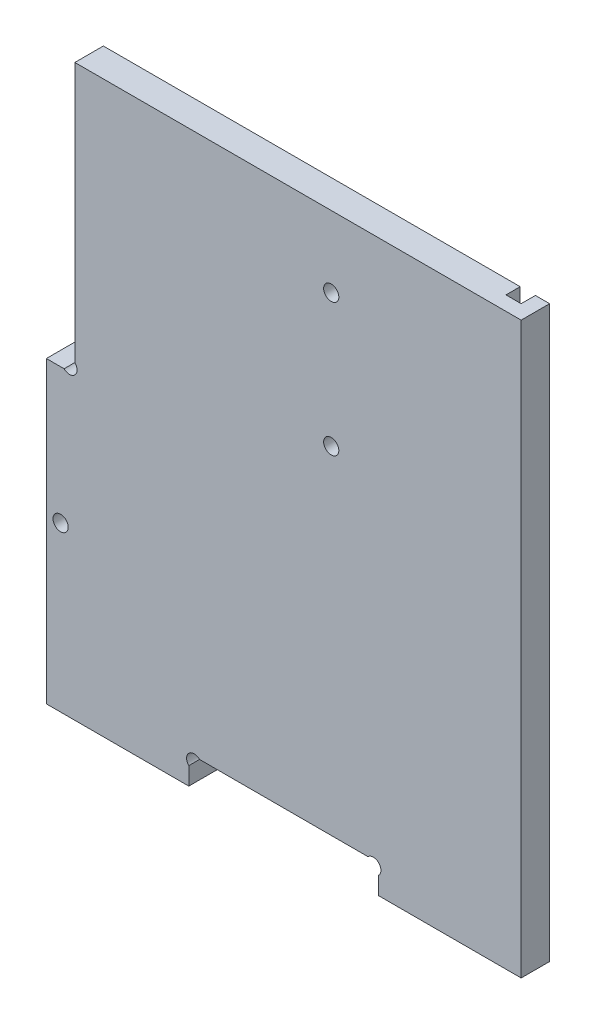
ISO-10303-21;
HEADER;
FILE_DESCRIPTION(('STEP AP214'),'2;1');
FILE_NAME('part.step','',(''),(''),'','','');
FILE_SCHEMA(('AUTOMOTIVE_DESIGN { 1 0 10303 214 1 1 1 1 }'));
ENDSEC;
DATA;
#1=APPLICATION_CONTEXT('core data for automotive mechanical design processes');
#2=APPLICATION_PROTOCOL_DEFINITION('international standard','automotive_design',2000,#1);
#3=PRODUCT_CONTEXT('',#1,'mechanical');
#4=PRODUCT('Part','Part','',(#3));
#5=PRODUCT_RELATED_PRODUCT_CATEGORY('part','',(#4));
#6=PRODUCT_DEFINITION_FORMATION('','',#4);
#7=PRODUCT_DEFINITION_CONTEXT('part definition',#1,'design');
#8=PRODUCT_DEFINITION('design','',#6,#7);
#9=PRODUCT_DEFINITION_SHAPE('','',#8);
#10=(LENGTH_UNIT() NAMED_UNIT(*) SI_UNIT(.MILLI.,.METRE.));
#11=(NAMED_UNIT(*) PLANE_ANGLE_UNIT() SI_UNIT($,.RADIAN.));
#12=(NAMED_UNIT(*) SI_UNIT($,.STERADIAN.) SOLID_ANGLE_UNIT());
#13=UNCERTAINTY_MEASURE_WITH_UNIT(LENGTH_MEASURE(1.E-05),#10,'distance_accuracy_value','');
#14=(GEOMETRIC_REPRESENTATION_CONTEXT(3) GLOBAL_UNCERTAINTY_ASSIGNED_CONTEXT((#13)) GLOBAL_UNIT_ASSIGNED_CONTEXT((#10,
#11,#12)) REPRESENTATION_CONTEXT('',''));
#15=CARTESIAN_POINT('',(0.,0.,0.));
#16=DIRECTION('',(0.,0.,1.));
#17=DIRECTION('',(1.,0.,0.));
#18=AXIS2_PLACEMENT_3D('',#15,#16,#17);
#19=CARTESIAN_POINT('',(18.8686291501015,-1.13137084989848,0.));
#20=DIRECTION('',(0.,0.,1.));
#21=DIRECTION('',(1.,0.,0.));
#22=AXIS2_PLACEMENT_3D('',#19,#20,#21);
#23=PLANE('',#22);
#24=DIRECTION('',(1.,0.,0.));
#25=VECTOR('',#24,1.);
#26=CARTESIAN_POINT('',(50.,-6.,0.));
#27=LINE('',#26,#25);
#28=CARTESIAN_POINT('',(47.,-5.99999999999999,0.));
#29=VERTEX_POINT('',#28);
#30=CARTESIAN_POINT('',(50.,-6.,0.));
#31=VERTEX_POINT('',#30);
#32=EDGE_CURVE('E108',#29,#31,#27,.T.);
#33=ORIENTED_EDGE('',*,*,#32,.F.);
#34=DIRECTION('',(0.,-1.,0.));
#35=VECTOR('',#34,1.);
#36=CARTESIAN_POINT('',(47.,116.031055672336,0.));
#37=LINE('',#36,#35);
#38=CARTESIAN_POINT('',(47.,114.,0.));
#39=VERTEX_POINT('',#38);
#40=EDGE_CURVE('E264',#39,#29,#37,.T.);
#41=ORIENTED_EDGE('',*,*,#40,.F.);
#42=DIRECTION('',(-1.,0.,0.));
#43=VECTOR('',#42,1.);
#44=CARTESIAN_POINT('',(-44.,114.,0.));
#45=LINE('',#44,#43);
#46=CARTESIAN_POINT('',(50.,114.,0.));
#47=VERTEX_POINT('',#46);
#48=EDGE_CURVE('E182',#47,#39,#45,.T.);
#49=ORIENTED_EDGE('',*,*,#48,.F.);
#50=DIRECTION('',(0.,1.,0.));
#51=VECTOR('',#50,1.);
#52=CARTESIAN_POINT('',(50.,114.,0.));
#53=LINE('',#52,#51);
#54=EDGE_CURVE('E177',#31,#47,#53,.T.);
#55=ORIENTED_EDGE('',*,*,#54,.F.);
#56=EDGE_LOOP('',(#33,#41,#49,#55));
#57=FACE_BOUND('',#56,.T.);
#58=ADVANCED_FACE('F37',(#57),#23,.F.);
#59=CARTESIAN_POINT('',(18.8686291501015,-1.13137084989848,6.));
#60=DIRECTION('',(0.,0.,1.));
#61=DIRECTION('',(1.,0.,0.));
#62=AXIS2_PLACEMENT_3D('',#59,#60,#61);
#63=PLANE('',#62);
#64=CARTESIAN_POINT('',(10.,99.,6.));
#65=DIRECTION('',(0.,0.,1.));
#66=DIRECTION('',(1.,0.,0.));
#67=AXIS2_PLACEMENT_3D('',#64,#65,#66);
#68=CIRCLE('',#67,1.60000000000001);
#69=CARTESIAN_POINT('',(11.6,99.,6.));
#70=VERTEX_POINT('',#69);
#71=EDGE_CURVE('E309',#70,#70,#68,.T.);
#72=ORIENTED_EDGE('',*,*,#71,.F.);
#73=EDGE_LOOP('',(#72));
#74=FACE_BOUND('',#73,.T.);
#75=DIRECTION('',(0.,1.,0.));
#76=VECTOR('',#75,1.);
#77=CARTESIAN_POINT('',(50.,114.,6.));
#78=LINE('',#77,#76);
#79=CARTESIAN_POINT('',(50.,-6.,6.));
#80=VERTEX_POINT('',#79);
#81=CARTESIAN_POINT('',(50.,114.,6.));
#82=VERTEX_POINT('',#81);
#83=EDGE_CURVE('E207',#80,#82,#78,.T.);
#84=ORIENTED_EDGE('',*,*,#83,.T.);
#85=DIRECTION('',(-1.,0.,0.));
#86=VECTOR('',#85,1.);
#87=CARTESIAN_POINT('',(-44.,114.,6.));
#88=LINE('',#87,#86);
#89=CARTESIAN_POINT('',(-44.,114.,6.));
#90=VERTEX_POINT('',#89);
#91=EDGE_CURVE('E117',#82,#90,#88,.T.);
#92=ORIENTED_EDGE('',*,*,#91,.T.);
#93=DIRECTION('',(0.,-1.,0.));
#94=VECTOR('',#93,1.);
#95=CARTESIAN_POINT('',(-44.,59.2627416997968,6.));
#96=LINE('',#95,#94);
#97=CARTESIAN_POINT('',(-44.,59.2627416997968,6.));
#98=VERTEX_POINT('',#97);
#99=EDGE_CURVE('E321',#90,#98,#96,.T.);
#100=ORIENTED_EDGE('',*,*,#99,.T.);
#101=CARTESIAN_POINT('',(-45.1313708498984,58.1313708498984,6.));
#102=DIRECTION('',(0.,0.,-1.));
#103=DIRECTION('',(-1.,0.,0.));
#104=AXIS2_PLACEMENT_3D('',#101,#102,#103);
#105=CIRCLE('',#104,1.59999999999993);
#106=CARTESIAN_POINT('',(-46.2627416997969,57.,6.));
#107=VERTEX_POINT('',#106);
#108=EDGE_CURVE('E323',#98,#107,#105,.T.);
#109=ORIENTED_EDGE('',*,*,#108,.T.);
#110=DIRECTION('',(-1.,0.,0.));
#111=VECTOR('',#110,1.);
#112=CARTESIAN_POINT('',(-46.2627416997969,57.,6.));
#113=LINE('',#112,#111);
#114=CARTESIAN_POINT('',(-50.,57.,6.));
#115=VERTEX_POINT('',#114);
#116=EDGE_CURVE('E325',#107,#115,#113,.T.);
#117=ORIENTED_EDGE('',*,*,#116,.T.);
#118=DIRECTION('',(0.,-1.,0.));
#119=VECTOR('',#118,1.);
#120=CARTESIAN_POINT('',(-50.,57.,6.));
#121=LINE('',#120,#119);
#122=CARTESIAN_POINT('',(-50.,-6.,6.));
#123=VERTEX_POINT('',#122);
#124=EDGE_CURVE('E327',#115,#123,#121,.T.);
#125=ORIENTED_EDGE('',*,*,#124,.T.);
#126=DIRECTION('',(1.,0.,0.));
#127=VECTOR('',#126,1.);
#128=CARTESIAN_POINT('',(-20.,-6.,6.));
#129=LINE('',#128,#127);
#130=CARTESIAN_POINT('',(-20.,-6.,6.));
#131=VERTEX_POINT('',#130);
#132=EDGE_CURVE('E329',#123,#131,#129,.T.);
#133=ORIENTED_EDGE('',*,*,#132,.T.);
#134=DIRECTION('',(0.,1.,0.));
#135=VECTOR('',#134,1.);
#136=CARTESIAN_POINT('',(-20.,-2.26274169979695,6.));
#137=LINE('',#136,#135);
#138=CARTESIAN_POINT('',(-20.,-2.26274169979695,6.));
#139=VERTEX_POINT('',#138);
#140=EDGE_CURVE('E331',#131,#139,#137,.T.);
#141=ORIENTED_EDGE('',*,*,#140,.T.);
#142=CARTESIAN_POINT('',(-18.8686291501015,-1.13137084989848,6.));
#143=DIRECTION('',(0.,0.,-1.));
#144=DIRECTION('',(-1.,0.,0.));
#145=AXIS2_PLACEMENT_3D('',#142,#143,#144);
#146=CIRCLE('',#145,1.6);
#147=CARTESIAN_POINT('',(-17.737258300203,0.,6.));
#148=VERTEX_POINT('',#147);
#149=EDGE_CURVE('E333',#139,#148,#146,.T.);
#150=ORIENTED_EDGE('',*,*,#149,.T.);
#151=DIRECTION('',(1.,0.,0.));
#152=VECTOR('',#151,1.);
#153=CARTESIAN_POINT('',(17.737258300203,0.,6.));
#154=LINE('',#153,#152);
#155=CARTESIAN_POINT('',(17.737258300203,0.,6.));
#156=VERTEX_POINT('',#155);
#157=EDGE_CURVE('E155',#148,#156,#154,.T.);
#158=ORIENTED_EDGE('',*,*,#157,.T.);
#159=CARTESIAN_POINT('',(18.8686291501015,-1.13137084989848,6.));
#160=DIRECTION('',(0.,0.,-1.));
#161=DIRECTION('',(1.,0.,0.));
#162=AXIS2_PLACEMENT_3D('',#159,#160,#161);
#163=CIRCLE('',#162,1.6);
#164=CARTESIAN_POINT('',(20.,-2.26274169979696,6.));
#165=VERTEX_POINT('',#164);
#166=EDGE_CURVE('E147',#156,#165,#163,.T.);
#167=ORIENTED_EDGE('',*,*,#166,.T.);
#168=DIRECTION('',(0.,-1.,0.));
#169=VECTOR('',#168,1.);
#170=CARTESIAN_POINT('',(20.,-6.,6.));
#171=LINE('',#170,#169);
#172=CARTESIAN_POINT('',(20.,-6.,6.));
#173=VERTEX_POINT('',#172);
#174=EDGE_CURVE('E152',#165,#173,#171,.T.);
#175=ORIENTED_EDGE('',*,*,#174,.T.);
#176=DIRECTION('',(1.,0.,0.));
#177=VECTOR('',#176,1.);
#178=CARTESIAN_POINT('',(50.,-6.,6.));
#179=LINE('',#178,#177);
#180=EDGE_CURVE('E61',#173,#80,#179,.T.);
#181=ORIENTED_EDGE('',*,*,#180,.T.);
#182=EDGE_LOOP('',(#84,#92,#100,#109,#117,#125,#133,#141,#150,#158,#167,#175,#181));
#183=FACE_BOUND('',#182,.T.);
#184=CARTESIAN_POINT('',(10.,71.,6.));
#185=DIRECTION('',(0.,0.,1.));
#186=DIRECTION('',(-1.,0.,0.));
#187=AXIS2_PLACEMENT_3D('',#184,#185,#186);
#188=CIRCLE('',#187,1.60000000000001);
#189=CARTESIAN_POINT('',(8.4,71.,6.));
#190=VERTEX_POINT('',#189);
#191=EDGE_CURVE('E181',#190,#190,#188,.T.);
#192=ORIENTED_EDGE('',*,*,#191,.F.);
#193=EDGE_LOOP('',(#192));
#194=FACE_BOUND('',#193,.T.);
#195=CARTESIAN_POINT('',(-47.,28.5,6.));
#196=DIRECTION('',(0.,0.,1.));
#197=DIRECTION('',(-1.,0.,0.));
#198=AXIS2_PLACEMENT_3D('',#195,#196,#197);
#199=CIRCLE('',#198,1.6);
#200=CARTESIAN_POINT('',(-48.6,28.5,6.));
#201=VERTEX_POINT('',#200);
#202=EDGE_CURVE('E303',#201,#201,#199,.T.);
#203=ORIENTED_EDGE('',*,*,#202,.F.);
#204=EDGE_LOOP('',(#203));
#205=FACE_BOUND('',#204,.T.);
#206=ADVANCED_FACE('F149',(#74,#183,#194,#205),#63,.T.);
#207=CARTESIAN_POINT('',(10.0000000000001,63.5000000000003,0.));
#208=DIRECTION('',(0.,0.,-1.));
#209=DIRECTION('',(-1.,0.,0.));
#210=AXIS2_PLACEMENT_3D('',#207,#208,#209);
#211=CIRCLE('',#210,1.09999999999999);
#212=CARTESIAN_POINT('',(8.90000000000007,63.5000000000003,0.));
#213=VERTEX_POINT('',#212);
#214=EDGE_CURVE('E278',#213,#213,#211,.T.);
#215=ORIENTED_EDGE('',*,*,#214,.F.);
#216=EDGE_LOOP('',(#215));
#217=FACE_BOUND('',#216,.T.);
#218=CARTESIAN_POINT('',(10.,78.4999999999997,0.));
#219=DIRECTION('',(0.,0.,-1.));
#220=DIRECTION('',(-1.,0.,0.));
#221=AXIS2_PLACEMENT_3D('',#218,#219,#220);
#222=CIRCLE('',#221,1.09999999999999);
#223=CARTESIAN_POINT('',(8.90000000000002,78.4999999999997,0.));
#224=VERTEX_POINT('',#223);
#225=EDGE_CURVE('E282',#224,#224,#222,.T.);
#226=ORIENTED_EDGE('',*,*,#225,.F.);
#227=EDGE_LOOP('',(#226));
#228=FACE_BOUND('',#227,.T.);
#229=CARTESIAN_POINT('',(2.5,99.,0.));
#230=DIRECTION('',(0.,0.,-1.));
#231=DIRECTION('',(1.,0.,0.));
#232=AXIS2_PLACEMENT_3D('',#229,#230,#231);
#233=CIRCLE('',#232,1.1);
#234=CARTESIAN_POINT('',(3.6,99.,0.));
#235=VERTEX_POINT('',#234);
#236=EDGE_CURVE('E288',#235,#235,#233,.T.);
#237=ORIENTED_EDGE('',*,*,#236,.F.);
#238=EDGE_LOOP('',(#237));
#239=FACE_BOUND('',#238,.T.);
#240=CARTESIAN_POINT('',(17.5,99.,0.));
#241=DIRECTION('',(0.,0.,-1.));
#242=DIRECTION('',(-1.,0.,0.));
#243=AXIS2_PLACEMENT_3D('',#240,#241,#242);
#244=CIRCLE('',#243,1.1);
#245=CARTESIAN_POINT('',(16.4,99.,0.));
#246=VERTEX_POINT('',#245);
#247=EDGE_CURVE('E294',#246,#246,#244,.T.);
#248=ORIENTED_EDGE('',*,*,#247,.F.);
#249=EDGE_LOOP('',(#248));
#250=FACE_BOUND('',#249,.T.);
#251=CARTESIAN_POINT('',(10.,99.,0.));
#252=DIRECTION('',(0.,0.,1.));
#253=DIRECTION('',(1.,0.,0.));
#254=AXIS2_PLACEMENT_3D('',#251,#252,#253);
#255=CIRCLE('',#254,1.60000000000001);
#256=CARTESIAN_POINT('',(11.6,99.,0.));
#257=VERTEX_POINT('',#256);
#258=EDGE_CURVE('E306',#257,#257,#255,.T.);
#259=ORIENTED_EDGE('',*,*,#258,.T.);
#260=EDGE_LOOP('',(#259));
#261=FACE_BOUND('',#260,.T.);
#262=CARTESIAN_POINT('',(43.8,114.,0.));
#263=VERTEX_POINT('',#262);
#264=CARTESIAN_POINT('',(-44.,114.,0.));
#265=VERTEX_POINT('',#264);
#266=EDGE_CURVE('E180',#263,#265,#45,.T.);
#267=ORIENTED_EDGE('',*,*,#266,.F.);
#268=DIRECTION('',(0.,1.,0.));
#269=VECTOR('',#268,1.);
#270=CARTESIAN_POINT('',(43.8,116.031055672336,0.));
#271=LINE('',#270,#269);
#272=CARTESIAN_POINT('',(43.8,-5.99999999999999,0.));
#273=VERTEX_POINT('',#272);
#274=EDGE_CURVE('E253',#273,#263,#271,.T.);
#275=ORIENTED_EDGE('',*,*,#274,.F.);
#276=CARTESIAN_POINT('',(20.,-6.,0.));
#277=VERTEX_POINT('',#276);
#278=EDGE_CURVE('E204',#277,#273,#27,.T.);
#279=ORIENTED_EDGE('',*,*,#278,.F.);
#280=DIRECTION('',(0.,-1.,0.));
#281=VECTOR('',#280,1.);
#282=CARTESIAN_POINT('',(20.,-6.,0.));
#283=LINE('',#282,#281);
#284=CARTESIAN_POINT('',(20.,-2.26274169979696,0.));
#285=VERTEX_POINT('',#284);
#286=EDGE_CURVE('E202',#285,#277,#283,.T.);
#287=ORIENTED_EDGE('',*,*,#286,.F.);
#288=CARTESIAN_POINT('',(18.8686291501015,-1.13137084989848,0.));
#289=DIRECTION('',(0.,0.,-1.));
#290=DIRECTION('',(1.,0.,0.));
#291=AXIS2_PLACEMENT_3D('',#288,#289,#290);
#292=CIRCLE('',#291,1.6);
#293=CARTESIAN_POINT('',(17.737258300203,0.,0.));
#294=VERTEX_POINT('',#293);
#295=EDGE_CURVE('E164',#294,#285,#292,.T.);
#296=ORIENTED_EDGE('',*,*,#295,.F.);
#297=DIRECTION('',(1.,0.,0.));
#298=VECTOR('',#297,1.);
#299=CARTESIAN_POINT('',(17.737258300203,0.,0.));
#300=LINE('',#299,#298);
#301=CARTESIAN_POINT('',(-17.737258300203,0.,0.));
#302=VERTEX_POINT('',#301);
#303=EDGE_CURVE('E199',#302,#294,#300,.T.);
#304=ORIENTED_EDGE('',*,*,#303,.F.);
#305=CARTESIAN_POINT('',(-18.8686291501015,-1.13137084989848,0.));
#306=DIRECTION('',(0.,0.,-1.));
#307=DIRECTION('',(-1.,0.,0.));
#308=AXIS2_PLACEMENT_3D('',#305,#306,#307);
#309=CIRCLE('',#308,1.6);
#310=CARTESIAN_POINT('',(-20.,-2.26274169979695,0.));
#311=VERTEX_POINT('',#310);
#312=EDGE_CURVE('E197',#311,#302,#309,.T.);
#313=ORIENTED_EDGE('',*,*,#312,.F.);
#314=DIRECTION('',(0.,1.,0.));
#315=VECTOR('',#314,1.);
#316=CARTESIAN_POINT('',(-20.,-2.26274169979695,0.));
#317=LINE('',#316,#315);
#318=CARTESIAN_POINT('',(-20.,-6.,0.));
#319=VERTEX_POINT('',#318);
#320=EDGE_CURVE('E195',#319,#311,#317,.T.);
#321=ORIENTED_EDGE('',*,*,#320,.F.);
#322=DIRECTION('',(1.,0.,0.));
#323=VECTOR('',#322,1.);
#324=CARTESIAN_POINT('',(-20.,-6.,0.));
#325=LINE('',#324,#323);
#326=CARTESIAN_POINT('',(-50.,-6.,0.));
#327=VERTEX_POINT('',#326);
#328=EDGE_CURVE('E193',#327,#319,#325,.T.);
#329=ORIENTED_EDGE('',*,*,#328,.F.);
#330=DIRECTION('',(0.,-1.,0.));
#331=VECTOR('',#330,1.);
#332=CARTESIAN_POINT('',(-50.,57.,0.));
#333=LINE('',#332,#331);
#334=CARTESIAN_POINT('',(-50.,57.,0.));
#335=VERTEX_POINT('',#334);
#336=EDGE_CURVE('E191',#335,#327,#333,.T.);
#337=ORIENTED_EDGE('',*,*,#336,.F.);
#338=DIRECTION('',(-1.,0.,0.));
#339=VECTOR('',#338,1.);
#340=CARTESIAN_POINT('',(-46.2627416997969,57.,0.));
#341=LINE('',#340,#339);
#342=CARTESIAN_POINT('',(-46.2627416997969,57.,0.));
#343=VERTEX_POINT('',#342);
#344=EDGE_CURVE('E189',#343,#335,#341,.T.);
#345=ORIENTED_EDGE('',*,*,#344,.F.);
#346=CARTESIAN_POINT('',(-45.1313708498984,58.1313708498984,0.));
#347=DIRECTION('',(0.,0.,-1.));
#348=DIRECTION('',(-1.,0.,0.));
#349=AXIS2_PLACEMENT_3D('',#346,#347,#348);
#350=CIRCLE('',#349,1.59999999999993);
#351=CARTESIAN_POINT('',(-44.,59.2627416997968,0.));
#352=VERTEX_POINT('',#351);
#353=EDGE_CURVE('E187',#352,#343,#350,.T.);
#354=ORIENTED_EDGE('',*,*,#353,.F.);
#355=DIRECTION('',(0.,-1.,0.));
#356=VECTOR('',#355,1.);
#357=CARTESIAN_POINT('',(-44.,59.2627416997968,0.));
#358=LINE('',#357,#356);
#359=EDGE_CURVE('E185',#265,#352,#358,.T.);
#360=ORIENTED_EDGE('',*,*,#359,.F.);
#361=EDGE_LOOP('',(#267,#275,#279,#287,#296,#304,#313,#321,#329,#337,#345,#354,#360));
#362=FACE_BOUND('',#361,.T.);
#363=CARTESIAN_POINT('',(10.,71.,0.));
#364=DIRECTION('',(0.,0.,1.));
#365=DIRECTION('',(-1.,0.,0.));
#366=AXIS2_PLACEMENT_3D('',#363,#364,#365);
#367=CIRCLE('',#366,1.60000000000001);
#368=CARTESIAN_POINT('',(8.4,71.,0.));
#369=VERTEX_POINT('',#368);
#370=EDGE_CURVE('E312',#369,#369,#367,.T.);
#371=ORIENTED_EDGE('',*,*,#370,.T.);
#372=EDGE_LOOP('',(#371));
#373=FACE_BOUND('',#372,.T.);
#374=CARTESIAN_POINT('',(-47.,28.5,0.));
#375=DIRECTION('',(0.,0.,1.));
#376=DIRECTION('',(-1.,0.,0.));
#377=AXIS2_PLACEMENT_3D('',#374,#375,#376);
#378=CIRCLE('',#377,1.6);
#379=CARTESIAN_POINT('',(-48.6,28.5,0.));
#380=VERTEX_POINT('',#379);
#381=EDGE_CURVE('E300',#380,#380,#378,.T.);
#382=ORIENTED_EDGE('',*,*,#381,.T.);
#383=EDGE_LOOP('',(#382));
#384=FACE_BOUND('',#383,.T.);
#385=ADVANCED_FACE('F261',(#217,#228,#239,#250,#261,#362,#373,#384),#23,.F.);
#386=CARTESIAN_POINT('',(50.,114.,6.));
#387=DIRECTION('',(-1.,0.,0.));
#388=DIRECTION('',(0.,0.,1.));
#389=AXIS2_PLACEMENT_3D('',#386,#387,#388);
#390=PLANE('',#389);
#391=ORIENTED_EDGE('',*,*,#54,.T.);
#392=DIRECTION('',(0.,0.,-1.));
#393=VECTOR('',#392,1.);
#394=CARTESIAN_POINT('',(50.,114.,6.));
#395=LINE('',#394,#393);
#396=EDGE_CURVE('E235',#82,#47,#395,.T.);
#397=ORIENTED_EDGE('',*,*,#396,.F.);
#398=ORIENTED_EDGE('',*,*,#83,.F.);
#399=DIRECTION('',(0.,0.,-1.));
#400=VECTOR('',#399,1.);
#401=CARTESIAN_POINT('',(50.,-6.,6.));
#402=LINE('',#401,#400);
#403=EDGE_CURVE('E173',#80,#31,#402,.T.);
#404=ORIENTED_EDGE('',*,*,#403,.T.);
#405=EDGE_LOOP('',(#391,#397,#398,#404));
#406=FACE_BOUND('',#405,.T.);
#407=ADVANCED_FACE('F39',(#406),#390,.F.);
#408=CARTESIAN_POINT('',(-44.,114.,6.));
#409=DIRECTION('',(0.,-1.,0.));
#410=DIRECTION('',(0.,0.,-1.));
#411=AXIS2_PLACEMENT_3D('',#408,#409,#410);
#412=PLANE('',#411);
#413=ORIENTED_EDGE('',*,*,#48,.T.);
#414=DIRECTION('',(0.,0.,1.));
#415=VECTOR('',#414,1.);
#416=CARTESIAN_POINT('',(47.,114.,6.));
#417=LINE('',#416,#415);
#418=CARTESIAN_POINT('',(47.,114.,3.));
#419=VERTEX_POINT('',#418);
#420=EDGE_CURVE('E275',#39,#419,#417,.T.);
#421=ORIENTED_EDGE('',*,*,#420,.T.);
#422=DIRECTION('',(1.,0.,0.));
#423=VECTOR('',#422,1.);
#424=CARTESIAN_POINT('',(-44.,114.,3.));
#425=LINE('',#424,#423);
#426=CARTESIAN_POINT('',(43.8,114.,3.));
#427=VERTEX_POINT('',#426);
#428=EDGE_CURVE('E271',#427,#419,#425,.T.);
#429=ORIENTED_EDGE('',*,*,#428,.F.);
#430=DIRECTION('',(0.,0.,-1.));
#431=VECTOR('',#430,1.);
#432=CARTESIAN_POINT('',(43.8,114.,6.));
#433=LINE('',#432,#431);
#434=EDGE_CURVE('E273',#427,#263,#433,.T.);
#435=ORIENTED_EDGE('',*,*,#434,.T.);
#436=ORIENTED_EDGE('',*,*,#266,.T.);
#437=DIRECTION('',(0.,0.,-1.));
#438=VECTOR('',#437,1.);
#439=CARTESIAN_POINT('',(-44.,114.,6.));
#440=LINE('',#439,#438);
#441=EDGE_CURVE('E232',#90,#265,#440,.T.);
#442=ORIENTED_EDGE('',*,*,#441,.F.);
#443=ORIENTED_EDGE('',*,*,#91,.F.);
#444=ORIENTED_EDGE('',*,*,#396,.T.);
#445=EDGE_LOOP('',(#413,#421,#429,#435,#436,#442,#443,#444));
#446=FACE_BOUND('',#445,.T.);
#447=ADVANCED_FACE('F350',(#446),#412,.F.);
#448=CARTESIAN_POINT('',(-44.,59.2627416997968,6.));
#449=DIRECTION('',(1.,0.,0.));
#450=DIRECTION('',(0.,0.,-1.));
#451=AXIS2_PLACEMENT_3D('',#448,#449,#450);
#452=PLANE('',#451);
#453=ORIENTED_EDGE('',*,*,#359,.T.);
#454=DIRECTION('',(0.,0.,-1.));
#455=VECTOR('',#454,1.);
#456=CARTESIAN_POINT('',(-44.,59.2627416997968,6.));
#457=LINE('',#456,#455);
#458=EDGE_CURVE('E229',#98,#352,#457,.T.);
#459=ORIENTED_EDGE('',*,*,#458,.F.);
#460=ORIENTED_EDGE('',*,*,#99,.F.);
#461=ORIENTED_EDGE('',*,*,#441,.T.);
#462=EDGE_LOOP('',(#453,#459,#460,#461));
#463=FACE_BOUND('',#462,.T.);
#464=ADVANCED_FACE('F352',(#463),#452,.F.);
#465=CARTESIAN_POINT('',(-45.1313708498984,58.1313708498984,6.));
#466=DIRECTION('',(0.,0.,-1.));
#467=DIRECTION('',(-1.,0.,0.));
#468=AXIS2_PLACEMENT_3D('',#465,#466,#467);
#469=CYLINDRICAL_SURFACE('',#468,1.59999999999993);
#470=ORIENTED_EDGE('',*,*,#353,.T.);
#471=DIRECTION('',(0.,0.,-1.));
#472=VECTOR('',#471,1.);
#473=CARTESIAN_POINT('',(-46.2627416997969,57.,6.));
#474=LINE('',#473,#472);
#475=EDGE_CURVE('E226',#107,#343,#474,.T.);
#476=ORIENTED_EDGE('',*,*,#475,.F.);
#477=ORIENTED_EDGE('',*,*,#108,.F.);
#478=ORIENTED_EDGE('',*,*,#458,.T.);
#479=EDGE_LOOP('',(#470,#476,#477,#478));
#480=FACE_BOUND('',#479,.T.);
#481=ADVANCED_FACE('F357',(#480),#469,.F.);
#482=CARTESIAN_POINT('',(-46.2627416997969,57.,6.));
#483=DIRECTION('',(0.,-1.,0.));
#484=DIRECTION('',(0.,0.,-1.));
#485=AXIS2_PLACEMENT_3D('',#482,#483,#484);
#486=PLANE('',#485);
#487=ORIENTED_EDGE('',*,*,#344,.T.);
#488=DIRECTION('',(0.,0.,-1.));
#489=VECTOR('',#488,1.);
#490=CARTESIAN_POINT('',(-50.,57.,6.));
#491=LINE('',#490,#489);
#492=EDGE_CURVE('E223',#115,#335,#491,.T.);
#493=ORIENTED_EDGE('',*,*,#492,.F.);
#494=ORIENTED_EDGE('',*,*,#116,.F.);
#495=ORIENTED_EDGE('',*,*,#475,.T.);
#496=EDGE_LOOP('',(#487,#493,#494,#495));
#497=FACE_BOUND('',#496,.T.);
#498=ADVANCED_FACE('F363',(#497),#486,.F.);
#499=CARTESIAN_POINT('',(-50.,57.,6.));
#500=DIRECTION('',(1.,0.,0.));
#501=DIRECTION('',(0.,0.,-1.));
#502=AXIS2_PLACEMENT_3D('',#499,#500,#501);
#503=PLANE('',#502);
#504=ORIENTED_EDGE('',*,*,#336,.T.);
#505=DIRECTION('',(0.,0.,-1.));
#506=VECTOR('',#505,1.);
#507=CARTESIAN_POINT('',(-50.,-6.,6.));
#508=LINE('',#507,#506);
#509=EDGE_CURVE('E220',#123,#327,#508,.T.);
#510=ORIENTED_EDGE('',*,*,#509,.F.);
#511=ORIENTED_EDGE('',*,*,#124,.F.);
#512=ORIENTED_EDGE('',*,*,#492,.T.);
#513=EDGE_LOOP('',(#504,#510,#511,#512));
#514=FACE_BOUND('',#513,.T.);
#515=ADVANCED_FACE('F367',(#514),#503,.F.);
#516=CARTESIAN_POINT('',(-20.,-6.,6.));
#517=DIRECTION('',(0.,1.,0.));
#518=DIRECTION('',(-1.,0.,0.));
#519=AXIS2_PLACEMENT_3D('',#516,#517,#518);
#520=PLANE('',#519);
#521=ORIENTED_EDGE('',*,*,#328,.T.);
#522=DIRECTION('',(0.,0.,-1.));
#523=VECTOR('',#522,1.);
#524=CARTESIAN_POINT('',(-20.,-6.,6.));
#525=LINE('',#524,#523);
#526=EDGE_CURVE('E217',#131,#319,#525,.T.);
#527=ORIENTED_EDGE('',*,*,#526,.F.);
#528=ORIENTED_EDGE('',*,*,#132,.F.);
#529=ORIENTED_EDGE('',*,*,#509,.T.);
#530=EDGE_LOOP('',(#521,#527,#528,#529));
#531=FACE_BOUND('',#530,.T.);
#532=ADVANCED_FACE('F372',(#531),#520,.F.);
#533=CARTESIAN_POINT('',(-20.,-2.26274169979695,6.));
#534=DIRECTION('',(-1.,0.,0.));
#535=DIRECTION('',(0.,0.,1.));
#536=AXIS2_PLACEMENT_3D('',#533,#534,#535);
#537=PLANE('',#536);
#538=ORIENTED_EDGE('',*,*,#320,.T.);
#539=DIRECTION('',(0.,0.,-1.));
#540=VECTOR('',#539,1.);
#541=CARTESIAN_POINT('',(-20.,-2.26274169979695,6.));
#542=LINE('',#541,#540);
#543=EDGE_CURVE('E214',#139,#311,#542,.T.);
#544=ORIENTED_EDGE('',*,*,#543,.F.);
#545=ORIENTED_EDGE('',*,*,#140,.F.);
#546=ORIENTED_EDGE('',*,*,#526,.T.);
#547=EDGE_LOOP('',(#538,#544,#545,#546));
#548=FACE_BOUND('',#547,.T.);
#549=ADVANCED_FACE('F375',(#548),#537,.F.);
#550=CARTESIAN_POINT('',(-18.8686291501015,-1.13137084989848,6.));
#551=DIRECTION('',(0.,0.,-1.));
#552=DIRECTION('',(-1.,0.,0.));
#553=AXIS2_PLACEMENT_3D('',#550,#551,#552);
#554=CYLINDRICAL_SURFACE('',#553,1.6);
#555=ORIENTED_EDGE('',*,*,#312,.T.);
#556=DIRECTION('',(0.,0.,-1.));
#557=VECTOR('',#556,1.);
#558=CARTESIAN_POINT('',(-17.737258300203,0.,6.));
#559=LINE('',#558,#557);
#560=EDGE_CURVE('E211',#148,#302,#559,.T.);
#561=ORIENTED_EDGE('',*,*,#560,.F.);
#562=ORIENTED_EDGE('',*,*,#149,.F.);
#563=ORIENTED_EDGE('',*,*,#543,.T.);
#564=EDGE_LOOP('',(#555,#561,#562,#563));
#565=FACE_BOUND('',#564,.T.);
#566=ADVANCED_FACE('F339',(#565),#554,.F.);
#567=CARTESIAN_POINT('',(17.737258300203,0.,6.));
#568=DIRECTION('',(0.,1.,0.));
#569=DIRECTION('',(0.,0.,1.));
#570=AXIS2_PLACEMENT_3D('',#567,#568,#569);
#571=PLANE('',#570);
#572=ORIENTED_EDGE('',*,*,#303,.T.);
#573=DIRECTION('',(0.,0.,-1.));
#574=VECTOR('',#573,1.);
#575=CARTESIAN_POINT('',(17.737258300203,0.,6.));
#576=LINE('',#575,#574);
#577=EDGE_CURVE('E167',#156,#294,#576,.T.);
#578=ORIENTED_EDGE('',*,*,#577,.F.);
#579=ORIENTED_EDGE('',*,*,#157,.F.);
#580=ORIENTED_EDGE('',*,*,#560,.T.);
#581=EDGE_LOOP('',(#572,#578,#579,#580));
#582=FACE_BOUND('',#581,.T.);
#583=ADVANCED_FACE('F343',(#582),#571,.F.);
#584=CARTESIAN_POINT('',(18.8686291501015,-1.13137084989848,6.));
#585=DIRECTION('',(0.,0.,-1.));
#586=DIRECTION('',(-1.,0.,0.));
#587=AXIS2_PLACEMENT_3D('',#584,#585,#586);
#588=CYLINDRICAL_SURFACE('',#587,1.6);
#589=ORIENTED_EDGE('',*,*,#295,.T.);
#590=DIRECTION('',(0.,0.,-1.));
#591=VECTOR('',#590,1.);
#592=CARTESIAN_POINT('',(20.,-2.26274169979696,6.));
#593=LINE('',#592,#591);
#594=EDGE_CURVE('E161',#165,#285,#593,.T.);
#595=ORIENTED_EDGE('',*,*,#594,.F.);
#596=ORIENTED_EDGE('',*,*,#166,.F.);
#597=ORIENTED_EDGE('',*,*,#577,.T.);
#598=EDGE_LOOP('',(#589,#595,#596,#597));
#599=FACE_BOUND('',#598,.T.);
#600=ADVANCED_FACE('F162',(#599),#588,.F.);
#601=CARTESIAN_POINT('',(20.,-6.,6.));
#602=DIRECTION('',(1.,0.,0.));
#603=DIRECTION('',(0.,1.,0.));
#604=AXIS2_PLACEMENT_3D('',#601,#602,#603);
#605=PLANE('',#604);
#606=ORIENTED_EDGE('',*,*,#286,.T.);
#607=DIRECTION('',(0.,0.,-1.));
#608=VECTOR('',#607,1.);
#609=CARTESIAN_POINT('',(20.,-6.,6.));
#610=LINE('',#609,#608);
#611=EDGE_CURVE('E168',#173,#277,#610,.T.);
#612=ORIENTED_EDGE('',*,*,#611,.F.);
#613=ORIENTED_EDGE('',*,*,#174,.F.);
#614=ORIENTED_EDGE('',*,*,#594,.T.);
#615=EDGE_LOOP('',(#606,#612,#613,#614));
#616=FACE_BOUND('',#615,.T.);
#617=ADVANCED_FACE('F170',(#616),#605,.F.);
#618=CARTESIAN_POINT('',(50.,-6.,6.));
#619=DIRECTION('',(0.,1.,0.));
#620=DIRECTION('',(-1.,0.,0.));
#621=AXIS2_PLACEMENT_3D('',#618,#619,#620);
#622=PLANE('',#621);
#623=DIRECTION('',(-1.,0.,0.));
#624=VECTOR('',#623,1.);
#625=CARTESIAN_POINT('',(50.,-6.,3.));
#626=LINE('',#625,#624);
#627=CARTESIAN_POINT('',(47.,-6.,3.));
#628=VERTEX_POINT('',#627);
#629=CARTESIAN_POINT('',(43.8,-5.99999999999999,3.));
#630=VERTEX_POINT('',#629);
#631=EDGE_CURVE('E237',#628,#630,#626,.T.);
#632=ORIENTED_EDGE('',*,*,#631,.F.);
#633=DIRECTION('',(0.,0.,-1.));
#634=VECTOR('',#633,1.);
#635=CARTESIAN_POINT('',(47.,-6.,6.));
#636=LINE('',#635,#634);
#637=EDGE_CURVE('E11',#628,#29,#636,.T.);
#638=ORIENTED_EDGE('',*,*,#637,.T.);
#639=ORIENTED_EDGE('',*,*,#32,.T.);
#640=ORIENTED_EDGE('',*,*,#403,.F.);
#641=ORIENTED_EDGE('',*,*,#180,.F.);
#642=ORIENTED_EDGE('',*,*,#611,.T.);
#643=ORIENTED_EDGE('',*,*,#278,.T.);
#644=DIRECTION('',(0.,0.,1.));
#645=VECTOR('',#644,1.);
#646=CARTESIAN_POINT('',(43.8,-6.,6.));
#647=LINE('',#646,#645);
#648=EDGE_CURVE('E45',#273,#630,#647,.T.);
#649=ORIENTED_EDGE('',*,*,#648,.T.);
#650=EDGE_LOOP('',(#632,#638,#639,#640,#641,#642,#643,#649));
#651=FACE_BOUND('',#650,.T.);
#652=ADVANCED_FACE('F242',(#651),#622,.F.);
#653=CARTESIAN_POINT('',(10.,71.,6.));
#654=DIRECTION('',(0.,0.,-1.));
#655=DIRECTION('',(-1.,0.,0.));
#656=AXIS2_PLACEMENT_3D('',#653,#654,#655);
#657=CYLINDRICAL_SURFACE('',#656,1.60000000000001);
#658=ORIENTED_EDGE('',*,*,#191,.T.);
#659=EDGE_LOOP('',(#658));
#660=FACE_BOUND('',#659,.T.);
#661=ORIENTED_EDGE('',*,*,#370,.F.);
#662=EDGE_LOOP('',(#661));
#663=FACE_BOUND('',#662,.T.);
#664=ADVANCED_FACE('F411',(#660,#663),#657,.F.);
#665=CARTESIAN_POINT('',(10.,99.,6.));
#666=DIRECTION('',(0.,0.,-1.));
#667=DIRECTION('',(-1.,0.,0.));
#668=AXIS2_PLACEMENT_3D('',#665,#666,#667);
#669=CYLINDRICAL_SURFACE('',#668,1.60000000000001);
#670=ORIENTED_EDGE('',*,*,#71,.T.);
#671=EDGE_LOOP('',(#670));
#672=FACE_BOUND('',#671,.T.);
#673=ORIENTED_EDGE('',*,*,#258,.F.);
#674=EDGE_LOOP('',(#673));
#675=FACE_BOUND('',#674,.T.);
#676=ADVANCED_FACE('F408',(#672,#675),#669,.F.);
#677=CARTESIAN_POINT('',(-47.,28.5,6.));
#678=DIRECTION('',(0.,0.,-1.));
#679=DIRECTION('',(-1.,0.,0.));
#680=AXIS2_PLACEMENT_3D('',#677,#678,#679);
#681=CYLINDRICAL_SURFACE('',#680,1.6);
#682=ORIENTED_EDGE('',*,*,#202,.T.);
#683=EDGE_LOOP('',(#682));
#684=FACE_BOUND('',#683,.T.);
#685=ORIENTED_EDGE('',*,*,#381,.F.);
#686=EDGE_LOOP('',(#685));
#687=FACE_BOUND('',#686,.T.);
#688=ADVANCED_FACE('F410',(#684,#687),#681,.F.);
#689=CARTESIAN_POINT('',(17.5,99.,1.));
#690=DIRECTION('',(0.,0.,-1.));
#691=DIRECTION('',(-1.,0.,0.));
#692=AXIS2_PLACEMENT_3D('',#689,#690,#691);
#693=CYLINDRICAL_SURFACE('',#692,1.1);
#694=CARTESIAN_POINT('',(17.5,99.,1.));
#695=DIRECTION('',(0.,0.,-1.));
#696=DIRECTION('',(-1.,0.,0.));
#697=AXIS2_PLACEMENT_3D('',#694,#695,#696);
#698=CIRCLE('',#697,1.1);
#699=CARTESIAN_POINT('',(16.4,99.,1.));
#700=VERTEX_POINT('',#699);
#701=EDGE_CURVE('E297',#700,#700,#698,.T.);
#702=ORIENTED_EDGE('',*,*,#701,.F.);
#703=EDGE_LOOP('',(#702));
#704=FACE_BOUND('',#703,.T.);
#705=ORIENTED_EDGE('',*,*,#247,.T.);
#706=EDGE_LOOP('',(#705));
#707=FACE_BOUND('',#706,.T.);
#708=ADVANCED_FACE('F418',(#704,#707),#693,.F.);
#709=CARTESIAN_POINT('',(17.5,99.,1.));
#710=DIRECTION('',(0.,0.,-1.));
#711=DIRECTION('',(-1.,0.,0.));
#712=AXIS2_PLACEMENT_3D('',#709,#710,#711);
#713=PLANE('',#712);
#714=ORIENTED_EDGE('',*,*,#701,.T.);
#715=EDGE_LOOP('',(#714));
#716=FACE_BOUND('',#715,.T.);
#717=ADVANCED_FACE('F426',(#716),#713,.T.);
#718=CARTESIAN_POINT('',(2.5,99.,1.));
#719=DIRECTION('',(0.,0.,-1.));
#720=DIRECTION('',(-1.,0.,0.));
#721=AXIS2_PLACEMENT_3D('',#718,#719,#720);
#722=CYLINDRICAL_SURFACE('',#721,1.1);
#723=CARTESIAN_POINT('',(2.5,99.,1.));
#724=DIRECTION('',(0.,0.,-1.));
#725=DIRECTION('',(1.,0.,0.));
#726=AXIS2_PLACEMENT_3D('',#723,#724,#725);
#727=CIRCLE('',#726,1.1);
#728=CARTESIAN_POINT('',(3.6,99.,1.));
#729=VERTEX_POINT('',#728);
#730=EDGE_CURVE('E291',#729,#729,#727,.T.);
#731=ORIENTED_EDGE('',*,*,#730,.F.);
#732=EDGE_LOOP('',(#731));
#733=FACE_BOUND('',#732,.T.);
#734=ORIENTED_EDGE('',*,*,#236,.T.);
#735=EDGE_LOOP('',(#734));
#736=FACE_BOUND('',#735,.T.);
#737=ADVANCED_FACE('F430',(#733,#736),#722,.F.);
#738=CARTESIAN_POINT('',(2.5,99.,1.));
#739=DIRECTION('',(0.,0.,1.));
#740=DIRECTION('',(1.,0.,0.));
#741=AXIS2_PLACEMENT_3D('',#738,#739,#740);
#742=PLANE('',#741);
#743=ORIENTED_EDGE('',*,*,#730,.T.);
#744=EDGE_LOOP('',(#743));
#745=FACE_BOUND('',#744,.T.);
#746=ADVANCED_FACE('F434',(#745),#742,.F.);
#747=CARTESIAN_POINT('',(10.,78.4999999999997,1.));
#748=DIRECTION('',(0.,0.,-1.));
#749=DIRECTION('',(-1.,0.,0.));
#750=AXIS2_PLACEMENT_3D('',#747,#748,#749);
#751=CYLINDRICAL_SURFACE('',#750,1.09999999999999);
#752=CARTESIAN_POINT('',(10.,78.4999999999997,1.));
#753=DIRECTION('',(0.,0.,-1.));
#754=DIRECTION('',(-1.,0.,0.));
#755=AXIS2_PLACEMENT_3D('',#752,#753,#754);
#756=CIRCLE('',#755,1.09999999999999);
#757=CARTESIAN_POINT('',(8.90000000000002,78.4999999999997,1.));
#758=VERTEX_POINT('',#757);
#759=EDGE_CURVE('E285',#758,#758,#756,.T.);
#760=ORIENTED_EDGE('',*,*,#759,.F.);
#761=EDGE_LOOP('',(#760));
#762=FACE_BOUND('',#761,.T.);
#763=ORIENTED_EDGE('',*,*,#225,.T.);
#764=EDGE_LOOP('',(#763));
#765=FACE_BOUND('',#764,.T.);
#766=ADVANCED_FACE('F438',(#762,#765),#751,.F.);
#767=CARTESIAN_POINT('',(10.,78.4999999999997,1.));
#768=DIRECTION('',(0.,0.,-1.));
#769=DIRECTION('',(-1.,0.,0.));
#770=AXIS2_PLACEMENT_3D('',#767,#768,#769);
#771=PLANE('',#770);
#772=ORIENTED_EDGE('',*,*,#759,.T.);
#773=EDGE_LOOP('',(#772));
#774=FACE_BOUND('',#773,.T.);
#775=ADVANCED_FACE('F442',(#774),#771,.T.);
#776=CARTESIAN_POINT('',(10.0000000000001,63.5000000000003,1.));
#777=DIRECTION('',(0.,0.,-1.));
#778=DIRECTION('',(-1.,0.,0.));
#779=AXIS2_PLACEMENT_3D('',#776,#777,#778);
#780=CYLINDRICAL_SURFACE('',#779,1.09999999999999);
#781=CARTESIAN_POINT('',(10.0000000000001,63.5000000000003,1.));
#782=DIRECTION('',(0.,0.,-1.));
#783=DIRECTION('',(-1.,0.,0.));
#784=AXIS2_PLACEMENT_3D('',#781,#782,#783);
#785=CIRCLE('',#784,1.09999999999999);
#786=CARTESIAN_POINT('',(8.90000000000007,63.5000000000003,1.));
#787=VERTEX_POINT('',#786);
#788=EDGE_CURVE('E279',#787,#787,#785,.T.);
#789=ORIENTED_EDGE('',*,*,#788,.F.);
#790=EDGE_LOOP('',(#789));
#791=FACE_BOUND('',#790,.T.);
#792=ORIENTED_EDGE('',*,*,#214,.T.);
#793=EDGE_LOOP('',(#792));
#794=FACE_BOUND('',#793,.T.);
#795=ADVANCED_FACE('F446',(#791,#794),#780,.F.);
#796=CARTESIAN_POINT('',(10.0000000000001,63.5000000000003,1.));
#797=DIRECTION('',(0.,0.,-1.));
#798=DIRECTION('',(-1.,0.,0.));
#799=AXIS2_PLACEMENT_3D('',#796,#797,#798);
#800=PLANE('',#799);
#801=ORIENTED_EDGE('',*,*,#788,.T.);
#802=EDGE_LOOP('',(#801));
#803=FACE_BOUND('',#802,.T.);
#804=ADVANCED_FACE('F450',(#803),#800,.T.);
#805=CARTESIAN_POINT('',(47.,116.031055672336,3.));
#806=DIRECTION('',(1.,0.,0.));
#807=DIRECTION('',(0.,0.,-1.));
#808=AXIS2_PLACEMENT_3D('',#805,#806,#807);
#809=PLANE('',#808);
#810=ORIENTED_EDGE('',*,*,#40,.T.);
#811=ORIENTED_EDGE('',*,*,#637,.F.);
#812=DIRECTION('',(0.,-1.,0.));
#813=VECTOR('',#812,1.);
#814=CARTESIAN_POINT('',(47.,116.031055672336,3.));
#815=LINE('',#814,#813);
#816=EDGE_CURVE('E52',#419,#628,#815,.T.);
#817=ORIENTED_EDGE('',*,*,#816,.F.);
#818=ORIENTED_EDGE('',*,*,#420,.F.);
#819=EDGE_LOOP('',(#810,#811,#817,#818));
#820=FACE_BOUND('',#819,.T.);
#821=ADVANCED_FACE('F454',(#820),#809,.F.);
#822=CARTESIAN_POINT('',(43.8,116.031055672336,3.));
#823=DIRECTION('',(-1.,0.,0.));
#824=DIRECTION('',(0.,0.,1.));
#825=AXIS2_PLACEMENT_3D('',#822,#823,#824);
#826=PLANE('',#825);
#827=DIRECTION('',(0.,1.,0.));
#828=VECTOR('',#827,1.);
#829=CARTESIAN_POINT('',(43.8,116.031055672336,3.));
#830=LINE('',#829,#828);
#831=EDGE_CURVE('E256',#630,#427,#830,.T.);
#832=ORIENTED_EDGE('',*,*,#831,.F.);
#833=ORIENTED_EDGE('',*,*,#648,.F.);
#834=ORIENTED_EDGE('',*,*,#274,.T.);
#835=ORIENTED_EDGE('',*,*,#434,.F.);
#836=EDGE_LOOP('',(#832,#833,#834,#835));
#837=FACE_BOUND('',#836,.T.);
#838=ADVANCED_FACE('F250',(#837),#826,.F.);
#839=CARTESIAN_POINT('',(0.,0.,3.));
#840=DIRECTION('',(0.,0.,-1.));
#841=DIRECTION('',(-1.,0.,0.));
#842=AXIS2_PLACEMENT_3D('',#839,#840,#841);
#843=PLANE('',#842);
#844=ORIENTED_EDGE('',*,*,#428,.T.);
#845=ORIENTED_EDGE('',*,*,#816,.T.);
#846=ORIENTED_EDGE('',*,*,#631,.T.);
#847=ORIENTED_EDGE('',*,*,#831,.T.);
#848=EDGE_LOOP('',(#844,#845,#846,#847));
#849=FACE_BOUND('',#848,.T.);
#850=ADVANCED_FACE('F461',(#849),#843,.T.);
#851=CLOSED_SHELL('',(#58,#206,#385,#407,#447,#464,#481,#498,#515,#532,#549,#566,#583,#600,#617,
#652,#664,#676,#688,#708,#717,#737,#746,#766,#775,#795,#804,#821,#838,#850));
#852=MANIFOLD_SOLID_BREP('B2',#851);
#853=ADVANCED_BREP_SHAPE_REPRESENTATION('',(#18,#852),#14);
#854=SHAPE_DEFINITION_REPRESENTATION(#9,#853);
ENDSEC;
END-ISO-10303-21;
